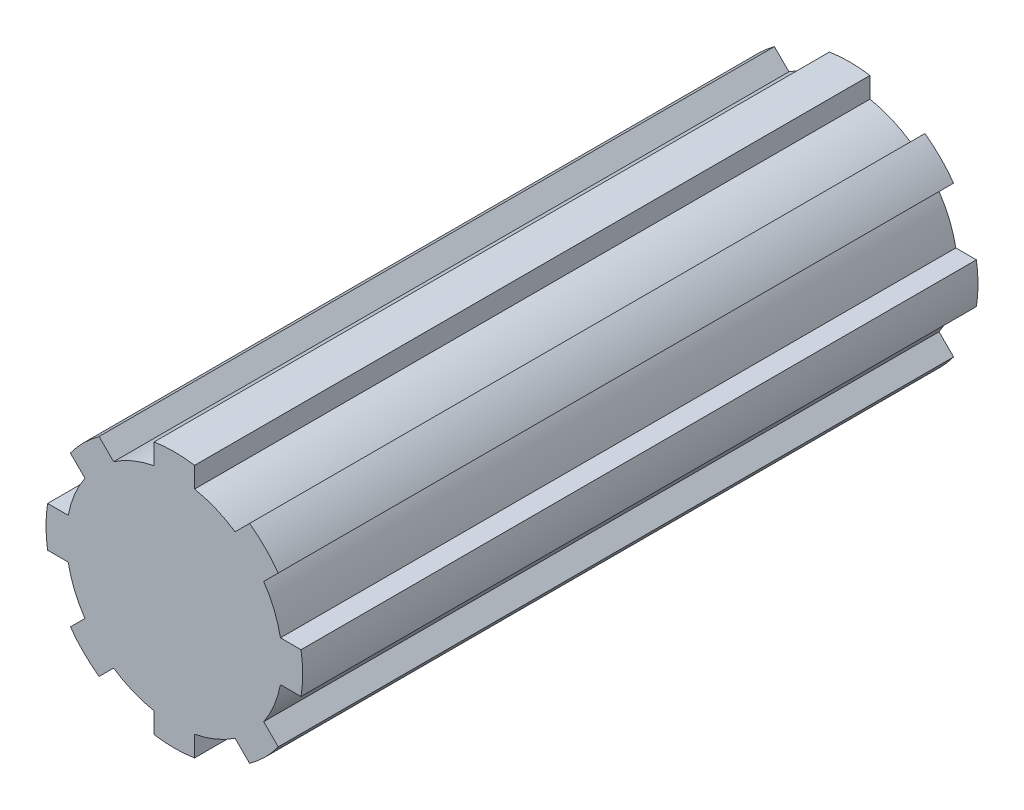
ISO-10303-21;
HEADER;
FILE_DESCRIPTION(('STEP AP214'),'2;1');
FILE_NAME('part.step','',(''),(''),'','','');
FILE_SCHEMA(('AUTOMOTIVE_DESIGN { 1 0 10303 214 1 1 1 1 }'));
ENDSEC;
DATA;
#1=APPLICATION_CONTEXT('core data for automotive mechanical design processes');
#2=APPLICATION_PROTOCOL_DEFINITION('international standard','automotive_design',2000,#1);
#3=PRODUCT_CONTEXT('',#1,'mechanical');
#4=PRODUCT('Part','Part','',(#3));
#5=PRODUCT_RELATED_PRODUCT_CATEGORY('part','',(#4));
#6=PRODUCT_DEFINITION_FORMATION('','',#4);
#7=PRODUCT_DEFINITION_CONTEXT('part definition',#1,'design');
#8=PRODUCT_DEFINITION('design','',#6,#7);
#9=PRODUCT_DEFINITION_SHAPE('','',#8);
#10=(LENGTH_UNIT() NAMED_UNIT(*) SI_UNIT(.MILLI.,.METRE.));
#11=(NAMED_UNIT(*) PLANE_ANGLE_UNIT() SI_UNIT($,.RADIAN.));
#12=(NAMED_UNIT(*) SI_UNIT($,.STERADIAN.) SOLID_ANGLE_UNIT());
#13=UNCERTAINTY_MEASURE_WITH_UNIT(LENGTH_MEASURE(1.E-05),#10,'distance_accuracy_value','');
#14=(GEOMETRIC_REPRESENTATION_CONTEXT(3) GLOBAL_UNCERTAINTY_ASSIGNED_CONTEXT((#13)) GLOBAL_UNIT_ASSIGNED_CONTEXT((#10,
#11,#12)) REPRESENTATION_CONTEXT('',''));
#15=CARTESIAN_POINT('',(0.,0.,0.));
#16=DIRECTION('',(0.,0.,1.));
#17=DIRECTION('',(1.,0.,0.));
#18=AXIS2_PLACEMENT_3D('',#15,#16,#17);
#19=CARTESIAN_POINT('',(0.,0.,50.));
#20=DIRECTION('',(0.,0.,-1.));
#21=DIRECTION('',(-1.,0.,0.));
#22=AXIS2_PLACEMENT_3D('',#19,#20,#21);
#23=CYLINDRICAL_SURFACE('',#22,16.);
#24=DIRECTION('',(0.,0.,-1.));
#25=VECTOR('',#24,1.);
#26=CARTESIAN_POINT('',(8.99173504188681,13.2343757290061,50.));
#27=LINE('',#26,#25);
#28=CARTESIAN_POINT('',(8.99173504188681,13.2343757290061,-50.));
#29=VERTEX_POINT('',#28);
#30=CARTESIAN_POINT('',(8.99173504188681,13.2343757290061,50.));
#31=VERTEX_POINT('',#30);
#32=EDGE_CURVE('E440',#29,#31,#27,.F.);
#33=ORIENTED_EDGE('',*,*,#32,.F.);
#34=CARTESIAN_POINT('',(0.,0.,-50.));
#35=DIRECTION('',(0.,0.,1.));
#36=DIRECTION('',(1.,0.,0.));
#37=AXIS2_PLACEMENT_3D('',#34,#35,#36);
#38=CIRCLE('',#37,16.);
#39=CARTESIAN_POINT('',(3.,15.7162336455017,-50.));
#40=VERTEX_POINT('',#39);
#41=EDGE_CURVE('E469',#29,#40,#38,.T.);
#42=ORIENTED_EDGE('',*,*,#41,.T.);
#43=DIRECTION('',(0.,0.,-1.));
#44=VECTOR('',#43,1.);
#45=CARTESIAN_POINT('',(3.,15.7162336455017,50.));
#46=LINE('',#45,#44);
#47=CARTESIAN_POINT('',(3.,15.7162336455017,50.));
#48=VERTEX_POINT('',#47);
#49=EDGE_CURVE('E464',#48,#40,#46,.T.);
#50=ORIENTED_EDGE('',*,*,#49,.F.);
#51=CARTESIAN_POINT('',(0.,0.,50.));
#52=DIRECTION('',(0.,0.,1.));
#53=DIRECTION('',(1.,0.,0.));
#54=AXIS2_PLACEMENT_3D('',#51,#52,#53);
#55=CIRCLE('',#54,16.);
#56=EDGE_CURVE('E41',#31,#48,#55,.T.);
#57=ORIENTED_EDGE('',*,*,#56,.F.);
#58=EDGE_LOOP('',(#33,#42,#50,#57));
#59=FACE_BOUND('',#58,.T.);
#60=ADVANCED_FACE('F32',(#59),#23,.T.);
#61=DIRECTION('',(0.,0.,-1.));
#62=VECTOR('',#61,1.);
#63=CARTESIAN_POINT('',(13.2343757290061,8.99173504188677,50.));
#64=LINE('',#63,#62);
#65=CARTESIAN_POINT('',(13.2343757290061,8.99173504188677,50.));
#66=VERTEX_POINT('',#65);
#67=CARTESIAN_POINT('',(13.2343757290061,8.99173504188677,-50.));
#68=VERTEX_POINT('',#67);
#69=EDGE_CURVE('E55',#66,#68,#64,.T.);
#70=ORIENTED_EDGE('',*,*,#69,.F.);
#71=CARTESIAN_POINT('',(15.7162336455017,2.99999999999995,50.));
#72=VERTEX_POINT('',#71);
#73=EDGE_CURVE('E476',#72,#66,#55,.T.);
#74=ORIENTED_EDGE('',*,*,#73,.F.);
#75=DIRECTION('',(0.,0.,-1.));
#76=VECTOR('',#75,1.);
#77=CARTESIAN_POINT('',(15.7162336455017,2.99999999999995,50.));
#78=LINE('',#77,#76);
#79=CARTESIAN_POINT('',(15.7162336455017,2.99999999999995,-50.));
#80=VERTEX_POINT('',#79);
#81=EDGE_CURVE('E436',#80,#72,#78,.F.);
#82=ORIENTED_EDGE('',*,*,#81,.F.);
#83=EDGE_CURVE('E472',#80,#68,#38,.T.);
#84=ORIENTED_EDGE('',*,*,#83,.T.);
#85=EDGE_LOOP('',(#70,#74,#82,#84));
#86=FACE_BOUND('',#85,.T.);
#87=ADVANCED_FACE('F522',(#86),#23,.T.);
#88=DIRECTION('',(0.,0.,-1.));
#89=VECTOR('',#88,1.);
#90=CARTESIAN_POINT('',(-8.99173504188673,13.2343757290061,50.));
#91=LINE('',#90,#89);
#92=CARTESIAN_POINT('',(-8.99173504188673,13.2343757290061,50.));
#93=VERTEX_POINT('',#92);
#94=CARTESIAN_POINT('',(-8.99173504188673,13.2343757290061,-50.));
#95=VERTEX_POINT('',#94);
#96=EDGE_CURVE('E433',#93,#95,#91,.T.);
#97=ORIENTED_EDGE('',*,*,#96,.F.);
#98=CARTESIAN_POINT('',(-3.,15.7162336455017,50.));
#99=VERTEX_POINT('',#98);
#100=EDGE_CURVE('E11',#99,#93,#55,.T.);
#101=ORIENTED_EDGE('',*,*,#100,.F.);
#102=DIRECTION('',(0.,0.,-1.));
#103=VECTOR('',#102,1.);
#104=CARTESIAN_POINT('',(-3.,15.7162336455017,50.));
#105=LINE('',#104,#103);
#106=CARTESIAN_POINT('',(-3.,15.7162336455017,-50.));
#107=VERTEX_POINT('',#106);
#108=EDGE_CURVE('E467',#107,#99,#105,.F.);
#109=ORIENTED_EDGE('',*,*,#108,.F.);
#110=EDGE_CURVE('E35',#107,#95,#38,.T.);
#111=ORIENTED_EDGE('',*,*,#110,.T.);
#112=EDGE_LOOP('',(#97,#101,#109,#111));
#113=FACE_BOUND('',#112,.T.);
#114=ADVANCED_FACE('F527',(#113),#23,.T.);
#115=DIRECTION('',(0.,0.,-1.));
#116=VECTOR('',#115,1.);
#117=CARTESIAN_POINT('',(15.7162336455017,-3.00000000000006,50.));
#118=LINE('',#117,#116);
#119=CARTESIAN_POINT('',(15.7162336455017,-3.00000000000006,50.));
#120=VERTEX_POINT('',#119);
#121=CARTESIAN_POINT('',(15.7162336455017,-3.00000000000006,-50.));
#122=VERTEX_POINT('',#121);
#123=EDGE_CURVE('E430',#120,#122,#118,.T.);
#124=ORIENTED_EDGE('',*,*,#123,.F.);
#125=CARTESIAN_POINT('',(13.234375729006,-8.99173504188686,50.));
#126=VERTEX_POINT('',#125);
#127=EDGE_CURVE('E505',#126,#120,#55,.T.);
#128=ORIENTED_EDGE('',*,*,#127,.F.);
#129=DIRECTION('',(0.,0.,-1.));
#130=VECTOR('',#129,1.);
#131=CARTESIAN_POINT('',(13.234375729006,-8.99173504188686,50.));
#132=LINE('',#131,#130);
#133=CARTESIAN_POINT('',(13.234375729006,-8.99173504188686,-50.));
#134=VERTEX_POINT('',#133);
#135=EDGE_CURVE('E427',#134,#126,#132,.F.);
#136=ORIENTED_EDGE('',*,*,#135,.F.);
#137=EDGE_CURVE('E473',#134,#122,#38,.T.);
#138=ORIENTED_EDGE('',*,*,#137,.T.);
#139=EDGE_LOOP('',(#124,#128,#136,#138));
#140=FACE_BOUND('',#139,.T.);
#141=ADVANCED_FACE('F490',(#140),#23,.T.);
#142=DIRECTION('',(0.,0.,-1.));
#143=VECTOR('',#142,1.);
#144=CARTESIAN_POINT('',(8.99173504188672,-13.2343757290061,50.));
#145=LINE('',#144,#143);
#146=CARTESIAN_POINT('',(8.99173504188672,-13.2343757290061,50.));
#147=VERTEX_POINT('',#146);
#148=CARTESIAN_POINT('',(8.99173504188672,-13.2343757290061,-50.));
#149=VERTEX_POINT('',#148);
#150=EDGE_CURVE('E424',#147,#149,#145,.T.);
#151=ORIENTED_EDGE('',*,*,#150,.F.);
#152=CARTESIAN_POINT('',(2.99999999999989,-15.7162336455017,50.));
#153=VERTEX_POINT('',#152);
#154=EDGE_CURVE('E506',#153,#147,#55,.T.);
#155=ORIENTED_EDGE('',*,*,#154,.F.);
#156=DIRECTION('',(0.,0.,-1.));
#157=VECTOR('',#156,1.);
#158=CARTESIAN_POINT('',(2.99999999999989,-15.7162336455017,50.));
#159=LINE('',#158,#157);
#160=CARTESIAN_POINT('',(2.99999999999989,-15.7162336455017,-50.));
#161=VERTEX_POINT('',#160);
#162=EDGE_CURVE('E421',#161,#153,#159,.F.);
#163=ORIENTED_EDGE('',*,*,#162,.F.);
#164=EDGE_CURVE('E483',#161,#149,#38,.T.);
#165=ORIENTED_EDGE('',*,*,#164,.T.);
#166=EDGE_LOOP('',(#151,#155,#163,#165));
#167=FACE_BOUND('',#166,.T.);
#168=ADVANCED_FACE('F576',(#167),#23,.T.);
#169=DIRECTION('',(0.,0.,-1.));
#170=VECTOR('',#169,1.);
#171=CARTESIAN_POINT('',(-3.00000000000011,-15.7162336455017,50.));
#172=LINE('',#171,#170);
#173=CARTESIAN_POINT('',(-3.00000000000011,-15.7162336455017,50.));
#174=VERTEX_POINT('',#173);
#175=CARTESIAN_POINT('',(-3.00000000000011,-15.7162336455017,-50.));
#176=VERTEX_POINT('',#175);
#177=EDGE_CURVE('E418',#174,#176,#172,.T.);
#178=ORIENTED_EDGE('',*,*,#177,.F.);
#179=CARTESIAN_POINT('',(-8.99173504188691,-13.234375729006,50.));
#180=VERTEX_POINT('',#179);
#181=EDGE_CURVE('E508',#180,#174,#55,.T.);
#182=ORIENTED_EDGE('',*,*,#181,.F.);
#183=DIRECTION('',(0.,0.,-1.));
#184=VECTOR('',#183,1.);
#185=CARTESIAN_POINT('',(-8.99173504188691,-13.234375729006,50.));
#186=LINE('',#185,#184);
#187=CARTESIAN_POINT('',(-8.99173504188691,-13.234375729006,-50.));
#188=VERTEX_POINT('',#187);
#189=EDGE_CURVE('E415',#188,#180,#186,.F.);
#190=ORIENTED_EDGE('',*,*,#189,.F.);
#191=EDGE_CURVE('E480',#188,#176,#38,.T.);
#192=ORIENTED_EDGE('',*,*,#191,.T.);
#193=EDGE_LOOP('',(#178,#182,#190,#192));
#194=FACE_BOUND('',#193,.T.);
#195=ADVANCED_FACE('F535',(#194),#23,.T.);
#196=DIRECTION('',(0.,0.,-1.));
#197=VECTOR('',#196,1.);
#198=CARTESIAN_POINT('',(-13.2343757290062,-8.99173504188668,50.));
#199=LINE('',#198,#197);
#200=CARTESIAN_POINT('',(-13.2343757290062,-8.99173504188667,50.));
#201=VERTEX_POINT('',#200);
#202=CARTESIAN_POINT('',(-13.2343757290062,-8.99173504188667,-50.));
#203=VERTEX_POINT('',#202);
#204=EDGE_CURVE('E412',#201,#203,#199,.T.);
#205=ORIENTED_EDGE('',*,*,#204,.F.);
#206=CARTESIAN_POINT('',(-15.7162336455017,-2.99999999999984,50.));
#207=VERTEX_POINT('',#206);
#208=EDGE_CURVE('E540',#207,#201,#55,.T.);
#209=ORIENTED_EDGE('',*,*,#208,.F.);
#210=DIRECTION('',(0.,0.,-1.));
#211=VECTOR('',#210,1.);
#212=CARTESIAN_POINT('',(-15.7162336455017,-2.99999999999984,50.));
#213=LINE('',#212,#211);
#214=CARTESIAN_POINT('',(-15.7162336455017,-2.99999999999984,-50.));
#215=VERTEX_POINT('',#214);
#216=EDGE_CURVE('E409',#215,#207,#213,.F.);
#217=ORIENTED_EDGE('',*,*,#216,.F.);
#218=EDGE_CURVE('E477',#215,#203,#38,.T.);
#219=ORIENTED_EDGE('',*,*,#218,.T.);
#220=EDGE_LOOP('',(#205,#209,#217,#219));
#221=FACE_BOUND('',#220,.T.);
#222=ADVANCED_FACE('F529',(#221),#23,.T.);
#223=DIRECTION('',(0.,0.,-1.));
#224=VECTOR('',#223,1.);
#225=CARTESIAN_POINT('',(-15.7162336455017,3.00000000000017,50.));
#226=LINE('',#225,#224);
#227=CARTESIAN_POINT('',(-15.7162336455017,3.00000000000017,50.));
#228=VERTEX_POINT('',#227);
#229=CARTESIAN_POINT('',(-15.7162336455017,3.00000000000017,-50.));
#230=VERTEX_POINT('',#229);
#231=EDGE_CURVE('E406',#228,#230,#226,.T.);
#232=ORIENTED_EDGE('',*,*,#231,.F.);
#233=CARTESIAN_POINT('',(-13.234375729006,8.99173504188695,50.));
#234=VERTEX_POINT('',#233);
#235=EDGE_CURVE('E40',#234,#228,#55,.T.);
#236=ORIENTED_EDGE('',*,*,#235,.F.);
#237=DIRECTION('',(0.,0.,-1.));
#238=VECTOR('',#237,1.);
#239=CARTESIAN_POINT('',(-13.234375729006,8.99173504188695,50.));
#240=LINE('',#239,#238);
#241=CARTESIAN_POINT('',(-13.234375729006,8.99173504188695,-50.));
#242=VERTEX_POINT('',#241);
#243=EDGE_CURVE('E250',#242,#234,#240,.F.);
#244=ORIENTED_EDGE('',*,*,#243,.F.);
#245=EDGE_CURVE('E474',#242,#230,#38,.T.);
#246=ORIENTED_EDGE('',*,*,#245,.T.);
#247=EDGE_LOOP('',(#232,#236,#244,#246));
#248=FACE_BOUND('',#247,.T.);
#249=ADVANCED_FACE('F523',(#248),#23,.T.);
#250=CARTESIAN_POINT('',(0.,0.,50.));
#251=DIRECTION('',(0.,0.,1.));
#252=DIRECTION('',(1.,0.,0.));
#253=AXIS2_PLACEMENT_3D('',#250,#251,#252);
#254=PLANE('',#253);
#255=ORIENTED_EDGE('',*,*,#73,.T.);
#256=DIRECTION('',(0.707106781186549,0.707106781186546,0.));
#257=VECTOR('',#256,1.);
#258=CARTESIAN_POINT('',(2.12132034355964,-2.12132034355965,50.));
#259=LINE('',#258,#257);
#260=CARTESIAN_POINT('',(15.3878195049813,11.1451788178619,50.));
#261=VERTEX_POINT('',#260);
#262=EDGE_CURVE('E391',#66,#261,#259,.T.);
#263=ORIENTED_EDGE('',*,*,#262,.T.);
#264=CARTESIAN_POINT('',(0.,0.,50.));
#265=DIRECTION('',(0.,0.,1.));
#266=DIRECTION('',(0.707106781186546,-0.707106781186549,0.));
#267=AXIS2_PLACEMENT_3D('',#264,#265,#266);
#268=CIRCLE('',#267,19.);
#269=CARTESIAN_POINT('',(11.145178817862,15.3878195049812,50.));
#270=VERTEX_POINT('',#269);
#271=EDGE_CURVE('E384',#261,#270,#268,.T.);
#272=ORIENTED_EDGE('',*,*,#271,.T.);
#273=DIRECTION('',(-0.707106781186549,-0.707106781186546,0.));
#274=VECTOR('',#273,1.);
#275=CARTESIAN_POINT('',(11.145178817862,15.3878195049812,50.));
#276=LINE('',#275,#274);
#277=EDGE_CURVE('E387',#270,#31,#276,.T.);
#278=ORIENTED_EDGE('',*,*,#277,.T.);
#279=ORIENTED_EDGE('',*,*,#56,.T.);
#280=DIRECTION('',(0.,1.,0.));
#281=VECTOR('',#280,1.);
#282=CARTESIAN_POINT('',(3.,0.,50.));
#283=LINE('',#282,#281);
#284=CARTESIAN_POINT('',(3.,18.7616630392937,50.));
#285=VERTEX_POINT('',#284);
#286=EDGE_CURVE('E450',#48,#285,#283,.T.);
#287=ORIENTED_EDGE('',*,*,#286,.T.);
#288=CARTESIAN_POINT('',(0.,0.,50.));
#289=DIRECTION('',(0.,0.,1.));
#290=DIRECTION('',(1.,0.,0.));
#291=AXIS2_PLACEMENT_3D('',#288,#289,#290);
#292=CIRCLE('',#291,19.);
#293=CARTESIAN_POINT('',(-3.,18.7616630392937,50.));
#294=VERTEX_POINT('',#293);
#295=EDGE_CURVE('E443',#285,#294,#292,.T.);
#296=ORIENTED_EDGE('',*,*,#295,.T.);
#297=DIRECTION('',(0.,-1.,0.));
#298=VECTOR('',#297,1.);
#299=CARTESIAN_POINT('',(-3.,18.7616630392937,50.));
#300=LINE('',#299,#298);
#301=EDGE_CURVE('E446',#294,#99,#300,.T.);
#302=ORIENTED_EDGE('',*,*,#301,.T.);
#303=ORIENTED_EDGE('',*,*,#100,.T.);
#304=DIRECTION('',(-0.707106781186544,0.707106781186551,0.));
#305=VECTOR('',#304,1.);
#306=CARTESIAN_POINT('',(15.3878195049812,-11.145178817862,50.));
#307=LINE('',#306,#305);
#308=CARTESIAN_POINT('',(-11.1451788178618,15.3878195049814,50.));
#309=VERTEX_POINT('',#308);
#310=EDGE_CURVE('E259',#93,#309,#307,.T.);
#311=ORIENTED_EDGE('',*,*,#310,.T.);
#312=CARTESIAN_POINT('',(0.,0.,50.));
#313=DIRECTION('',(0.,0.,1.));
#314=DIRECTION('',(0.707106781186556,0.707106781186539,0.));
#315=AXIS2_PLACEMENT_3D('',#312,#313,#314);
#316=CIRCLE('',#315,19.);
#317=CARTESIAN_POINT('',(-15.3878195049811,11.1451788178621,50.));
#318=VERTEX_POINT('',#317);
#319=EDGE_CURVE('E254',#309,#318,#316,.T.);
#320=ORIENTED_EDGE('',*,*,#319,.T.);
#321=DIRECTION('',(0.707106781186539,-0.707106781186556,0.));
#322=VECTOR('',#321,1.);
#323=CARTESIAN_POINT('',(-15.3878195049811,11.1451788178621,50.));
#324=LINE('',#323,#322);
#325=EDGE_CURVE('E243',#318,#234,#324,.T.);
#326=ORIENTED_EDGE('',*,*,#325,.T.);
#327=ORIENTED_EDGE('',*,*,#235,.T.);
#328=DIRECTION('',(-1.,0.,0.));
#329=VECTOR('',#328,1.);
#330=CARTESIAN_POINT('',(0.,3.,50.));
#331=LINE('',#330,#329);
#332=CARTESIAN_POINT('',(-18.7616630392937,3.0000000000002,50.));
#333=VERTEX_POINT('',#332);
#334=EDGE_CURVE('E283',#228,#333,#331,.T.);
#335=ORIENTED_EDGE('',*,*,#334,.T.);
#336=CARTESIAN_POINT('',(0.,0.,50.));
#337=DIRECTION('',(0.,0.,1.));
#338=DIRECTION('',(0.,1.,0.));
#339=AXIS2_PLACEMENT_3D('',#336,#337,#338);
#340=CIRCLE('',#339,19.);
#341=CARTESIAN_POINT('',(-18.7616630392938,-2.9999999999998,50.));
#342=VERTEX_POINT('',#341);
#343=EDGE_CURVE('E276',#333,#342,#340,.T.);
#344=ORIENTED_EDGE('',*,*,#343,.T.);
#345=DIRECTION('',(1.,0.,0.));
#346=VECTOR('',#345,1.);
#347=CARTESIAN_POINT('',(-18.7616630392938,-2.9999999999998,50.));
#348=LINE('',#347,#346);
#349=EDGE_CURVE('E279',#342,#207,#348,.T.);
#350=ORIENTED_EDGE('',*,*,#349,.T.);
#351=ORIENTED_EDGE('',*,*,#208,.T.);
#352=DIRECTION('',(-0.707106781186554,-0.707106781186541,0.));
#353=VECTOR('',#352,1.);
#354=CARTESIAN_POINT('',(-2.12132034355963,2.12132034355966,50.));
#355=LINE('',#354,#353);
#356=CARTESIAN_POINT('',(-15.3878195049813,-11.1451788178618,50.));
#357=VERTEX_POINT('',#356);
#358=EDGE_CURVE('E302',#201,#357,#355,.T.);
#359=ORIENTED_EDGE('',*,*,#358,.T.);
#360=CARTESIAN_POINT('',(0.,0.,50.));
#361=DIRECTION('',(0.,0.,1.));
#362=DIRECTION('',(-0.707106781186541,0.707106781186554,0.));
#363=AXIS2_PLACEMENT_3D('',#360,#361,#362);
#364=CIRCLE('',#363,19.);
#365=CARTESIAN_POINT('',(-11.1451788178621,-15.3878195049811,50.));
#366=VERTEX_POINT('',#365);
#367=EDGE_CURVE('E295',#357,#366,#364,.T.);
#368=ORIENTED_EDGE('',*,*,#367,.T.);
#369=DIRECTION('',(0.707106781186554,0.707106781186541,0.));
#370=VECTOR('',#369,1.);
#371=CARTESIAN_POINT('',(-11.1451788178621,-15.3878195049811,50.));
#372=LINE('',#371,#370);
#373=EDGE_CURVE('E298',#366,#180,#372,.T.);
#374=ORIENTED_EDGE('',*,*,#373,.T.);
#375=ORIENTED_EDGE('',*,*,#181,.T.);
#376=DIRECTION('',(0.,-1.,0.));
#377=VECTOR('',#376,1.);
#378=CARTESIAN_POINT('',(-3.,0.,50.));
#379=LINE('',#378,#377);
#380=CARTESIAN_POINT('',(-3.00000000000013,-18.7616630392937,50.));
#381=VERTEX_POINT('',#380);
#382=EDGE_CURVE('E324',#174,#381,#379,.T.);
#383=ORIENTED_EDGE('',*,*,#382,.T.);
#384=CARTESIAN_POINT('',(0.,0.,50.));
#385=DIRECTION('',(0.,0.,1.));
#386=DIRECTION('',(-1.,0.,0.));
#387=AXIS2_PLACEMENT_3D('',#384,#385,#386);
#388=CIRCLE('',#387,19.);
#389=CARTESIAN_POINT('',(2.99999999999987,-18.7616630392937,50.));
#390=VERTEX_POINT('',#389);
#391=EDGE_CURVE('E317',#381,#390,#388,.T.);
#392=ORIENTED_EDGE('',*,*,#391,.T.);
#393=DIRECTION('',(0.,1.,0.));
#394=VECTOR('',#393,1.);
#395=CARTESIAN_POINT('',(2.99999999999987,-18.7616630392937,50.));
#396=LINE('',#395,#394);
#397=EDGE_CURVE('E320',#390,#153,#396,.T.);
#398=ORIENTED_EDGE('',*,*,#397,.T.);
#399=ORIENTED_EDGE('',*,*,#154,.T.);
#400=DIRECTION('',(0.707106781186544,-0.707106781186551,0.));
#401=VECTOR('',#400,1.);
#402=CARTESIAN_POINT('',(-2.12132034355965,-2.12132034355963,50.));
#403=LINE('',#402,#401);
#404=CARTESIAN_POINT('',(11.1451788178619,-15.3878195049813,50.));
#405=VERTEX_POINT('',#404);
#406=EDGE_CURVE('E346',#147,#405,#403,.T.);
#407=ORIENTED_EDGE('',*,*,#406,.T.);
#408=CARTESIAN_POINT('',(0.,0.,50.));
#409=DIRECTION('',(0.,0.,1.));
#410=DIRECTION('',(-0.707106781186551,-0.707106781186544,0.));
#411=AXIS2_PLACEMENT_3D('',#408,#409,#410);
#412=CIRCLE('',#411,19.);
#413=CARTESIAN_POINT('',(15.3878195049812,-11.145178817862,50.));
#414=VERTEX_POINT('',#413);
#415=EDGE_CURVE('E339',#405,#414,#412,.T.);
#416=ORIENTED_EDGE('',*,*,#415,.T.);
#417=EDGE_CURVE('E343',#414,#126,#307,.T.);
#418=ORIENTED_EDGE('',*,*,#417,.T.);
#419=ORIENTED_EDGE('',*,*,#127,.T.);
#420=DIRECTION('',(1.,0.,0.));
#421=VECTOR('',#420,1.);
#422=CARTESIAN_POINT('',(0.,-3.,50.));
#423=LINE('',#422,#421);
#424=CARTESIAN_POINT('',(18.7616630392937,-3.00000000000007,50.));
#425=VERTEX_POINT('',#424);
#426=EDGE_CURVE('E369',#120,#425,#423,.T.);
#427=ORIENTED_EDGE('',*,*,#426,.T.);
#428=CARTESIAN_POINT('',(0.,0.,50.));
#429=DIRECTION('',(0.,0.,1.));
#430=DIRECTION('',(0.,-1.,0.));
#431=AXIS2_PLACEMENT_3D('',#428,#429,#430);
#432=CIRCLE('',#431,19.);
#433=CARTESIAN_POINT('',(18.7616630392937,2.99999999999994,50.));
#434=VERTEX_POINT('',#433);
#435=EDGE_CURVE('E362',#425,#434,#432,.T.);
#436=ORIENTED_EDGE('',*,*,#435,.T.);
#437=DIRECTION('',(-1.,0.,0.));
#438=VECTOR('',#437,1.);
#439=CARTESIAN_POINT('',(18.7616630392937,2.99999999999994,50.));
#440=LINE('',#439,#438);
#441=EDGE_CURVE('E365',#434,#72,#440,.T.);
#442=ORIENTED_EDGE('',*,*,#441,.T.);
#443=EDGE_LOOP('',(#255,#263,#272,#278,#279,#287,#296,#302,#303,#311,#320,#326,#327,#335,#344,
#350,#351,#359,#368,#374,#375,#383,#392,#398,#399,#407,#416,#418,#419,#427,#436,#442));
#444=FACE_BOUND('',#443,.T.);
#445=ADVANCED_FACE('F257',(#444),#254,.T.);
#446=CARTESIAN_POINT('',(0.,0.,-50.));
#447=DIRECTION('',(0.,0.,1.));
#448=DIRECTION('',(1.,0.,0.));
#449=AXIS2_PLACEMENT_3D('',#446,#447,#448);
#450=PLANE('',#449);
#451=ORIENTED_EDGE('',*,*,#41,.F.);
#452=DIRECTION('',(-0.707106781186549,-0.707106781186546,0.));
#453=VECTOR('',#452,1.);
#454=CARTESIAN_POINT('',(11.145178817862,15.3878195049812,-50.));
#455=LINE('',#454,#453);
#456=CARTESIAN_POINT('',(11.145178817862,15.3878195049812,-50.));
#457=VERTEX_POINT('',#456);
#458=EDGE_CURVE('E396',#457,#29,#455,.T.);
#459=ORIENTED_EDGE('',*,*,#458,.F.);
#460=CARTESIAN_POINT('',(0.,0.,-50.));
#461=DIRECTION('',(0.,0.,1.));
#462=DIRECTION('',(0.707106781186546,-0.707106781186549,0.));
#463=AXIS2_PLACEMENT_3D('',#460,#461,#462);
#464=CIRCLE('',#463,19.);
#465=CARTESIAN_POINT('',(15.3878195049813,11.1451788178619,-50.));
#466=VERTEX_POINT('',#465);
#467=EDGE_CURVE('E383',#466,#457,#464,.T.);
#468=ORIENTED_EDGE('',*,*,#467,.F.);
#469=DIRECTION('',(0.707106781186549,0.707106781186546,0.));
#470=VECTOR('',#469,1.);
#471=CARTESIAN_POINT('',(2.12132034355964,-2.12132034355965,-50.));
#472=LINE('',#471,#470);
#473=EDGE_CURVE('E388',#68,#466,#472,.T.);
#474=ORIENTED_EDGE('',*,*,#473,.F.);
#475=ORIENTED_EDGE('',*,*,#83,.F.);
#476=DIRECTION('',(-1.,0.,0.));
#477=VECTOR('',#476,1.);
#478=CARTESIAN_POINT('',(18.7616630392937,2.99999999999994,-50.));
#479=LINE('',#478,#477);
#480=CARTESIAN_POINT('',(18.7616630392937,2.99999999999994,-50.));
#481=VERTEX_POINT('',#480);
#482=EDGE_CURVE('E374',#481,#80,#479,.T.);
#483=ORIENTED_EDGE('',*,*,#482,.F.);
#484=CARTESIAN_POINT('',(0.,0.,-50.));
#485=DIRECTION('',(0.,0.,1.));
#486=DIRECTION('',(0.,-1.,0.));
#487=AXIS2_PLACEMENT_3D('',#484,#485,#486);
#488=CIRCLE('',#487,19.);
#489=CARTESIAN_POINT('',(18.7616630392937,-3.00000000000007,-50.));
#490=VERTEX_POINT('',#489);
#491=EDGE_CURVE('E361',#490,#481,#488,.T.);
#492=ORIENTED_EDGE('',*,*,#491,.F.);
#493=DIRECTION('',(1.,0.,0.));
#494=VECTOR('',#493,1.);
#495=CARTESIAN_POINT('',(0.,-3.,-50.));
#496=LINE('',#495,#494);
#497=EDGE_CURVE('E366',#122,#490,#496,.T.);
#498=ORIENTED_EDGE('',*,*,#497,.F.);
#499=ORIENTED_EDGE('',*,*,#137,.F.);
#500=DIRECTION('',(-0.707106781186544,0.707106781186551,0.));
#501=VECTOR('',#500,1.);
#502=CARTESIAN_POINT('',(15.3878195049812,-11.145178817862,-50.));
#503=LINE('',#502,#501);
#504=CARTESIAN_POINT('',(15.3878195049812,-11.145178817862,-50.));
#505=VERTEX_POINT('',#504);
#506=EDGE_CURVE('E352',#505,#134,#503,.T.);
#507=ORIENTED_EDGE('',*,*,#506,.F.);
#508=CARTESIAN_POINT('',(0.,0.,-50.));
#509=DIRECTION('',(0.,0.,1.));
#510=DIRECTION('',(-0.707106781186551,-0.707106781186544,0.));
#511=AXIS2_PLACEMENT_3D('',#508,#509,#510);
#512=CIRCLE('',#511,19.);
#513=CARTESIAN_POINT('',(11.1451788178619,-15.3878195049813,-50.));
#514=VERTEX_POINT('',#513);
#515=EDGE_CURVE('E338',#514,#505,#512,.T.);
#516=ORIENTED_EDGE('',*,*,#515,.F.);
#517=DIRECTION('',(0.707106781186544,-0.707106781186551,0.));
#518=VECTOR('',#517,1.);
#519=CARTESIAN_POINT('',(-2.12132034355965,-2.12132034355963,-50.));
#520=LINE('',#519,#518);
#521=EDGE_CURVE('E342',#149,#514,#520,.T.);
#522=ORIENTED_EDGE('',*,*,#521,.F.);
#523=ORIENTED_EDGE('',*,*,#164,.F.);
#524=DIRECTION('',(0.,1.,0.));
#525=VECTOR('',#524,1.);
#526=CARTESIAN_POINT('',(2.99999999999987,-18.7616630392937,-50.));
#527=LINE('',#526,#525);
#528=CARTESIAN_POINT('',(2.99999999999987,-18.7616630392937,-50.));
#529=VERTEX_POINT('',#528);
#530=EDGE_CURVE('E329',#529,#161,#527,.T.);
#531=ORIENTED_EDGE('',*,*,#530,.F.);
#532=CARTESIAN_POINT('',(0.,0.,-50.));
#533=DIRECTION('',(0.,0.,1.));
#534=DIRECTION('',(-1.,0.,0.));
#535=AXIS2_PLACEMENT_3D('',#532,#533,#534);
#536=CIRCLE('',#535,19.);
#537=CARTESIAN_POINT('',(-3.00000000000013,-18.7616630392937,-50.));
#538=VERTEX_POINT('',#537);
#539=EDGE_CURVE('E316',#538,#529,#536,.T.);
#540=ORIENTED_EDGE('',*,*,#539,.F.);
#541=DIRECTION('',(0.,-1.,0.));
#542=VECTOR('',#541,1.);
#543=CARTESIAN_POINT('',(-3.,0.,-50.));
#544=LINE('',#543,#542);
#545=EDGE_CURVE('E321',#176,#538,#544,.T.);
#546=ORIENTED_EDGE('',*,*,#545,.F.);
#547=ORIENTED_EDGE('',*,*,#191,.F.);
#548=DIRECTION('',(0.707106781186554,0.707106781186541,0.));
#549=VECTOR('',#548,1.);
#550=CARTESIAN_POINT('',(-11.1451788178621,-15.3878195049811,-50.));
#551=LINE('',#550,#549);
#552=CARTESIAN_POINT('',(-11.1451788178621,-15.3878195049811,-50.));
#553=VERTEX_POINT('',#552);
#554=EDGE_CURVE('E307',#553,#188,#551,.T.);
#555=ORIENTED_EDGE('',*,*,#554,.F.);
#556=CARTESIAN_POINT('',(0.,0.,-50.));
#557=DIRECTION('',(0.,0.,1.));
#558=DIRECTION('',(-0.707106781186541,0.707106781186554,0.));
#559=AXIS2_PLACEMENT_3D('',#556,#557,#558);
#560=CIRCLE('',#559,19.);
#561=CARTESIAN_POINT('',(-15.3878195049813,-11.1451788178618,-50.));
#562=VERTEX_POINT('',#561);
#563=EDGE_CURVE('E294',#562,#553,#560,.T.);
#564=ORIENTED_EDGE('',*,*,#563,.F.);
#565=DIRECTION('',(-0.707106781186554,-0.707106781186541,0.));
#566=VECTOR('',#565,1.);
#567=CARTESIAN_POINT('',(-2.12132034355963,2.12132034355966,-50.));
#568=LINE('',#567,#566);
#569=EDGE_CURVE('E299',#203,#562,#568,.T.);
#570=ORIENTED_EDGE('',*,*,#569,.F.);
#571=ORIENTED_EDGE('',*,*,#218,.F.);
#572=DIRECTION('',(1.,0.,0.));
#573=VECTOR('',#572,1.);
#574=CARTESIAN_POINT('',(-18.7616630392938,-2.9999999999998,-50.));
#575=LINE('',#574,#573);
#576=CARTESIAN_POINT('',(-18.7616630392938,-2.9999999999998,-50.));
#577=VERTEX_POINT('',#576);
#578=EDGE_CURVE('E271',#577,#215,#575,.T.);
#579=ORIENTED_EDGE('',*,*,#578,.F.);
#580=CARTESIAN_POINT('',(0.,0.,-50.));
#581=DIRECTION('',(0.,0.,1.));
#582=DIRECTION('',(0.,1.,0.));
#583=AXIS2_PLACEMENT_3D('',#580,#581,#582);
#584=CIRCLE('',#583,19.);
#585=CARTESIAN_POINT('',(-18.7616630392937,3.0000000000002,-50.));
#586=VERTEX_POINT('',#585);
#587=EDGE_CURVE('E268',#586,#577,#584,.T.);
#588=ORIENTED_EDGE('',*,*,#587,.F.);
#589=DIRECTION('',(-1.,0.,0.));
#590=VECTOR('',#589,1.);
#591=CARTESIAN_POINT('',(0.,3.,-50.));
#592=LINE('',#591,#590);
#593=EDGE_CURVE('E280',#230,#586,#592,.T.);
#594=ORIENTED_EDGE('',*,*,#593,.F.);
#595=ORIENTED_EDGE('',*,*,#245,.F.);
#596=DIRECTION('',(0.707106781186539,-0.707106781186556,0.));
#597=VECTOR('',#596,1.);
#598=CARTESIAN_POINT('',(-15.3878195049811,11.1451788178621,-50.));
#599=LINE('',#598,#597);
#600=CARTESIAN_POINT('',(-15.3878195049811,11.1451788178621,-50.));
#601=VERTEX_POINT('',#600);
#602=EDGE_CURVE('E263',#601,#242,#599,.T.);
#603=ORIENTED_EDGE('',*,*,#602,.F.);
#604=CARTESIAN_POINT('',(0.,0.,-50.));
#605=DIRECTION('',(0.,0.,1.));
#606=DIRECTION('',(0.707106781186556,0.707106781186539,0.));
#607=AXIS2_PLACEMENT_3D('',#604,#605,#606);
#608=CIRCLE('',#607,19.);
#609=CARTESIAN_POINT('',(-11.1451788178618,15.3878195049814,-50.));
#610=VERTEX_POINT('',#609);
#611=EDGE_CURVE('E267',#610,#601,#608,.T.);
#612=ORIENTED_EDGE('',*,*,#611,.F.);
#613=EDGE_CURVE('E351',#95,#610,#503,.T.);
#614=ORIENTED_EDGE('',*,*,#613,.F.);
#615=ORIENTED_EDGE('',*,*,#110,.F.);
#616=DIRECTION('',(0.,-1.,0.));
#617=VECTOR('',#616,1.);
#618=CARTESIAN_POINT('',(-3.,18.7616630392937,-50.));
#619=LINE('',#618,#617);
#620=CARTESIAN_POINT('',(-3.,18.7616630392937,-50.));
#621=VERTEX_POINT('',#620);
#622=EDGE_CURVE('E455',#621,#107,#619,.T.);
#623=ORIENTED_EDGE('',*,*,#622,.F.);
#624=CARTESIAN_POINT('',(0.,0.,-50.));
#625=DIRECTION('',(0.,0.,1.));
#626=DIRECTION('',(1.,0.,0.));
#627=AXIS2_PLACEMENT_3D('',#624,#625,#626);
#628=CIRCLE('',#627,19.);
#629=CARTESIAN_POINT('',(3.,18.7616630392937,-50.));
#630=VERTEX_POINT('',#629);
#631=EDGE_CURVE('E442',#630,#621,#628,.T.);
#632=ORIENTED_EDGE('',*,*,#631,.F.);
#633=DIRECTION('',(0.,1.,0.));
#634=VECTOR('',#633,1.);
#635=CARTESIAN_POINT('',(3.,0.,-50.));
#636=LINE('',#635,#634);
#637=EDGE_CURVE('E447',#40,#630,#636,.T.);
#638=ORIENTED_EDGE('',*,*,#637,.F.);
#639=EDGE_LOOP('',(#451,#459,#468,#474,#475,#483,#492,#498,#499,#507,#516,#522,#523,#531,#540,
#546,#547,#555,#564,#570,#571,#579,#588,#594,#595,#603,#612,#614,#615,#623,#632,#638));
#640=FACE_BOUND('',#639,.T.);
#641=ADVANCED_FACE('F499',(#640),#450,.F.);
#642=CARTESIAN_POINT('',(-3.,18.7616630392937,50.));
#643=DIRECTION('',(1.,0.,0.));
#644=DIRECTION('',(0.,1.,0.));
#645=AXIS2_PLACEMENT_3D('',#642,#643,#644);
#646=PLANE('',#645);
#647=ORIENTED_EDGE('',*,*,#622,.T.);
#648=ORIENTED_EDGE('',*,*,#108,.T.);
#649=ORIENTED_EDGE('',*,*,#301,.F.);
#650=DIRECTION('',(0.,0.,-1.));
#651=VECTOR('',#650,1.);
#652=CARTESIAN_POINT('',(-3.,18.7616630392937,50.));
#653=LINE('',#652,#651);
#654=EDGE_CURVE('E461',#294,#621,#653,.T.);
#655=ORIENTED_EDGE('',*,*,#654,.T.);
#656=EDGE_LOOP('',(#647,#648,#649,#655));
#657=FACE_BOUND('',#656,.T.);
#658=ADVANCED_FACE('F608',(#657),#646,.F.);
#659=CARTESIAN_POINT('',(3.,0.,50.));
#660=DIRECTION('',(-1.,0.,0.));
#661=DIRECTION('',(0.,0.,1.));
#662=AXIS2_PLACEMENT_3D('',#659,#660,#661);
#663=PLANE('',#662);
#664=ORIENTED_EDGE('',*,*,#286,.F.);
#665=ORIENTED_EDGE('',*,*,#49,.T.);
#666=ORIENTED_EDGE('',*,*,#637,.T.);
#667=DIRECTION('',(0.,0.,-1.));
#668=VECTOR('',#667,1.);
#669=CARTESIAN_POINT('',(3.,18.7616630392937,50.));
#670=LINE('',#669,#668);
#671=EDGE_CURVE('E452',#285,#630,#670,.T.);
#672=ORIENTED_EDGE('',*,*,#671,.F.);
#673=EDGE_LOOP('',(#664,#665,#666,#672));
#674=FACE_BOUND('',#673,.T.);
#675=ADVANCED_FACE('F617',(#674),#663,.F.);
#676=CARTESIAN_POINT('',(0.,0.,50.));
#677=DIRECTION('',(0.,0.,-1.));
#678=DIRECTION('',(-1.,0.,0.));
#679=AXIS2_PLACEMENT_3D('',#676,#677,#678);
#680=CYLINDRICAL_SURFACE('',#679,19.);
#681=ORIENTED_EDGE('',*,*,#631,.T.);
#682=ORIENTED_EDGE('',*,*,#654,.F.);
#683=ORIENTED_EDGE('',*,*,#295,.F.);
#684=ORIENTED_EDGE('',*,*,#671,.T.);
#685=EDGE_LOOP('',(#681,#682,#683,#684));
#686=FACE_BOUND('',#685,.T.);
#687=ADVANCED_FACE('F612',(#686),#680,.T.);
#688=CARTESIAN_POINT('',(0.,0.,50.));
#689=DIRECTION('',(0.,0.,-1.));
#690=DIRECTION('',(-1.,0.,0.));
#691=AXIS2_PLACEMENT_3D('',#688,#689,#690);
#692=CYLINDRICAL_SURFACE('',#691,19.);
#693=ORIENTED_EDGE('',*,*,#611,.T.);
#694=DIRECTION('',(0.,0.,-1.));
#695=VECTOR('',#694,1.);
#696=CARTESIAN_POINT('',(-15.3878195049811,11.1451788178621,50.));
#697=LINE('',#696,#695);
#698=EDGE_CURVE('E248',#318,#601,#697,.T.);
#699=ORIENTED_EDGE('',*,*,#698,.F.);
#700=ORIENTED_EDGE('',*,*,#319,.F.);
#701=DIRECTION('',(0.,0.,-1.));
#702=VECTOR('',#701,1.);
#703=CARTESIAN_POINT('',(-11.1451788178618,15.3878195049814,50.));
#704=LINE('',#703,#702);
#705=EDGE_CURVE('E253',#309,#610,#704,.T.);
#706=ORIENTED_EDGE('',*,*,#705,.T.);
#707=EDGE_LOOP('',(#693,#699,#700,#706));
#708=FACE_BOUND('',#707,.T.);
#709=ADVANCED_FACE('F265',(#708),#692,.T.);
#710=CARTESIAN_POINT('',(-15.3878195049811,11.1451788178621,50.));
#711=DIRECTION('',(0.707106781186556,0.707106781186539,0.));
#712=DIRECTION('',(-0.707106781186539,0.707106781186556,0.));
#713=AXIS2_PLACEMENT_3D('',#710,#711,#712);
#714=PLANE('',#713);
#715=ORIENTED_EDGE('',*,*,#602,.T.);
#716=ORIENTED_EDGE('',*,*,#243,.T.);
#717=ORIENTED_EDGE('',*,*,#325,.F.);
#718=ORIENTED_EDGE('',*,*,#698,.T.);
#719=EDGE_LOOP('',(#715,#716,#717,#718));
#720=FACE_BOUND('',#719,.T.);
#721=ADVANCED_FACE('F246',(#720),#714,.F.);
#722=CARTESIAN_POINT('',(15.3878195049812,-11.145178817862,50.));
#723=DIRECTION('',(-0.707106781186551,-0.707106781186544,0.));
#724=DIRECTION('',(0.707106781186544,-0.707106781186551,0.));
#725=AXIS2_PLACEMENT_3D('',#722,#723,#724);
#726=PLANE('',#725);
#727=ORIENTED_EDGE('',*,*,#310,.F.);
#728=ORIENTED_EDGE('',*,*,#96,.T.);
#729=ORIENTED_EDGE('',*,*,#613,.T.);
#730=ORIENTED_EDGE('',*,*,#705,.F.);
#731=EDGE_LOOP('',(#727,#728,#729,#730));
#732=FACE_BOUND('',#731,.T.);
#733=ADVANCED_FACE('F590',(#732),#726,.F.);
#734=CARTESIAN_POINT('',(0.,0.,50.));
#735=DIRECTION('',(0.,0.,-1.));
#736=DIRECTION('',(-1.,0.,0.));
#737=AXIS2_PLACEMENT_3D('',#734,#735,#736);
#738=CYLINDRICAL_SURFACE('',#737,19.);
#739=ORIENTED_EDGE('',*,*,#587,.T.);
#740=DIRECTION('',(0.,0.,-1.));
#741=VECTOR('',#740,1.);
#742=CARTESIAN_POINT('',(-18.7616630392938,-2.9999999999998,50.));
#743=LINE('',#742,#741);
#744=EDGE_CURVE('E291',#342,#577,#743,.T.);
#745=ORIENTED_EDGE('',*,*,#744,.F.);
#746=ORIENTED_EDGE('',*,*,#343,.F.);
#747=DIRECTION('',(0.,0.,-1.));
#748=VECTOR('',#747,1.);
#749=CARTESIAN_POINT('',(-18.7616630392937,3.0000000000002,50.));
#750=LINE('',#749,#748);
#751=EDGE_CURVE('E284',#333,#586,#750,.T.);
#752=ORIENTED_EDGE('',*,*,#751,.T.);
#753=EDGE_LOOP('',(#739,#745,#746,#752));
#754=FACE_BOUND('',#753,.T.);
#755=ADVANCED_FACE('F546',(#754),#738,.T.);
#756=CARTESIAN_POINT('',(-18.7616630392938,-2.9999999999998,50.));
#757=DIRECTION('',(0.,1.,0.));
#758=DIRECTION('',(-1.,0.,0.));
#759=AXIS2_PLACEMENT_3D('',#756,#757,#758);
#760=PLANE('',#759);
#761=ORIENTED_EDGE('',*,*,#578,.T.);
#762=ORIENTED_EDGE('',*,*,#216,.T.);
#763=ORIENTED_EDGE('',*,*,#349,.F.);
#764=ORIENTED_EDGE('',*,*,#744,.T.);
#765=EDGE_LOOP('',(#761,#762,#763,#764));
#766=FACE_BOUND('',#765,.T.);
#767=ADVANCED_FACE('F550',(#766),#760,.F.);
#768=CARTESIAN_POINT('',(0.,3.,50.));
#769=DIRECTION('',(0.,-1.,0.));
#770=DIRECTION('',(1.,0.,0.));
#771=AXIS2_PLACEMENT_3D('',#768,#769,#770);
#772=PLANE('',#771);
#773=ORIENTED_EDGE('',*,*,#334,.F.);
#774=ORIENTED_EDGE('',*,*,#231,.T.);
#775=ORIENTED_EDGE('',*,*,#593,.T.);
#776=ORIENTED_EDGE('',*,*,#751,.F.);
#777=EDGE_LOOP('',(#773,#774,#775,#776));
#778=FACE_BOUND('',#777,.T.);
#779=ADVANCED_FACE('F541',(#778),#772,.F.);
#780=CARTESIAN_POINT('',(0.,0.,50.));
#781=DIRECTION('',(0.,0.,-1.));
#782=DIRECTION('',(-1.,0.,0.));
#783=AXIS2_PLACEMENT_3D('',#780,#781,#782);
#784=CYLINDRICAL_SURFACE('',#783,19.);
#785=ORIENTED_EDGE('',*,*,#563,.T.);
#786=DIRECTION('',(0.,0.,-1.));
#787=VECTOR('',#786,1.);
#788=CARTESIAN_POINT('',(-11.1451788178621,-15.3878195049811,50.));
#789=LINE('',#788,#787);
#790=EDGE_CURVE('E313',#366,#553,#789,.T.);
#791=ORIENTED_EDGE('',*,*,#790,.F.);
#792=ORIENTED_EDGE('',*,*,#367,.F.);
#793=DIRECTION('',(0.,0.,-1.));
#794=VECTOR('',#793,1.);
#795=CARTESIAN_POINT('',(-15.3878195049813,-11.1451788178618,50.));
#796=LINE('',#795,#794);
#797=EDGE_CURVE('E304',#357,#562,#796,.T.);
#798=ORIENTED_EDGE('',*,*,#797,.T.);
#799=EDGE_LOOP('',(#785,#791,#792,#798));
#800=FACE_BOUND('',#799,.T.);
#801=ADVANCED_FACE('F558',(#800),#784,.T.);
#802=CARTESIAN_POINT('',(-11.1451788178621,-15.3878195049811,50.));
#803=DIRECTION('',(-0.707106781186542,0.707106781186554,0.));
#804=DIRECTION('',(-0.707106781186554,-0.707106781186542,0.));
#805=AXIS2_PLACEMENT_3D('',#802,#803,#804);
#806=PLANE('',#805);
#807=ORIENTED_EDGE('',*,*,#554,.T.);
#808=ORIENTED_EDGE('',*,*,#189,.T.);
#809=ORIENTED_EDGE('',*,*,#373,.F.);
#810=ORIENTED_EDGE('',*,*,#790,.T.);
#811=EDGE_LOOP('',(#807,#808,#809,#810));
#812=FACE_BOUND('',#811,.T.);
#813=ADVANCED_FACE('F563',(#812),#806,.F.);
#814=CARTESIAN_POINT('',(-2.12132034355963,2.12132034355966,50.));
#815=DIRECTION('',(0.707106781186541,-0.707106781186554,0.));
#816=DIRECTION('',(0.707106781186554,0.707106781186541,0.));
#817=AXIS2_PLACEMENT_3D('',#814,#815,#816);
#818=PLANE('',#817);
#819=ORIENTED_EDGE('',*,*,#358,.F.);
#820=ORIENTED_EDGE('',*,*,#204,.T.);
#821=ORIENTED_EDGE('',*,*,#569,.T.);
#822=ORIENTED_EDGE('',*,*,#797,.F.);
#823=EDGE_LOOP('',(#819,#820,#821,#822));
#824=FACE_BOUND('',#823,.T.);
#825=ADVANCED_FACE('F555',(#824),#818,.F.);
#826=CARTESIAN_POINT('',(0.,0.,50.));
#827=DIRECTION('',(0.,0.,-1.));
#828=DIRECTION('',(-1.,0.,0.));
#829=AXIS2_PLACEMENT_3D('',#826,#827,#828);
#830=CYLINDRICAL_SURFACE('',#829,19.);
#831=ORIENTED_EDGE('',*,*,#539,.T.);
#832=DIRECTION('',(0.,0.,-1.));
#833=VECTOR('',#832,1.);
#834=CARTESIAN_POINT('',(2.99999999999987,-18.7616630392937,50.));
#835=LINE('',#834,#833);
#836=EDGE_CURVE('E335',#390,#529,#835,.T.);
#837=ORIENTED_EDGE('',*,*,#836,.F.);
#838=ORIENTED_EDGE('',*,*,#391,.F.);
#839=DIRECTION('',(0.,0.,-1.));
#840=VECTOR('',#839,1.);
#841=CARTESIAN_POINT('',(-3.00000000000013,-18.7616630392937,50.));
#842=LINE('',#841,#840);
#843=EDGE_CURVE('E326',#381,#538,#842,.T.);
#844=ORIENTED_EDGE('',*,*,#843,.T.);
#845=EDGE_LOOP('',(#831,#837,#838,#844));
#846=FACE_BOUND('',#845,.T.);
#847=ADVANCED_FACE('F571',(#846),#830,.T.);
#848=CARTESIAN_POINT('',(2.99999999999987,-18.7616630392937,50.));
#849=DIRECTION('',(-1.,0.,0.));
#850=DIRECTION('',(0.,-1.,0.));
#851=AXIS2_PLACEMENT_3D('',#848,#849,#850);
#852=PLANE('',#851);
#853=ORIENTED_EDGE('',*,*,#530,.T.);
#854=ORIENTED_EDGE('',*,*,#162,.T.);
#855=ORIENTED_EDGE('',*,*,#397,.F.);
#856=ORIENTED_EDGE('',*,*,#836,.T.);
#857=EDGE_LOOP('',(#853,#854,#855,#856));
#858=FACE_BOUND('',#857,.T.);
#859=ADVANCED_FACE('F575',(#858),#852,.F.);
#860=CARTESIAN_POINT('',(-3.,0.,50.));
#861=DIRECTION('',(1.,0.,0.));
#862=DIRECTION('',(0.,1.,0.));
#863=AXIS2_PLACEMENT_3D('',#860,#861,#862);
#864=PLANE('',#863);
#865=ORIENTED_EDGE('',*,*,#382,.F.);
#866=ORIENTED_EDGE('',*,*,#177,.T.);
#867=ORIENTED_EDGE('',*,*,#545,.T.);
#868=ORIENTED_EDGE('',*,*,#843,.F.);
#869=EDGE_LOOP('',(#865,#866,#867,#868));
#870=FACE_BOUND('',#869,.T.);
#871=ADVANCED_FACE('F568',(#870),#864,.F.);
#872=CARTESIAN_POINT('',(0.,0.,50.));
#873=DIRECTION('',(0.,0.,-1.));
#874=DIRECTION('',(-1.,0.,0.));
#875=AXIS2_PLACEMENT_3D('',#872,#873,#874);
#876=CYLINDRICAL_SURFACE('',#875,19.);
#877=ORIENTED_EDGE('',*,*,#515,.T.);
#878=DIRECTION('',(0.,0.,-1.));
#879=VECTOR('',#878,1.);
#880=CARTESIAN_POINT('',(15.3878195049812,-11.145178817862,50.));
#881=LINE('',#880,#879);
#882=EDGE_CURVE('E358',#414,#505,#881,.T.);
#883=ORIENTED_EDGE('',*,*,#882,.F.);
#884=ORIENTED_EDGE('',*,*,#415,.F.);
#885=DIRECTION('',(0.,0.,-1.));
#886=VECTOR('',#885,1.);
#887=CARTESIAN_POINT('',(11.1451788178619,-15.3878195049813,50.));
#888=LINE('',#887,#886);
#889=EDGE_CURVE('E348',#405,#514,#888,.T.);
#890=ORIENTED_EDGE('',*,*,#889,.T.);
#891=EDGE_LOOP('',(#877,#883,#884,#890));
#892=FACE_BOUND('',#891,.T.);
#893=ADVANCED_FACE('F584',(#892),#876,.T.);
#894=ORIENTED_EDGE('',*,*,#506,.T.);
#895=ORIENTED_EDGE('',*,*,#135,.T.);
#896=ORIENTED_EDGE('',*,*,#417,.F.);
#897=ORIENTED_EDGE('',*,*,#882,.T.);
#898=EDGE_LOOP('',(#894,#895,#896,#897));
#899=FACE_BOUND('',#898,.T.);
#900=ADVANCED_FACE('F587',(#899),#726,.F.);
#901=CARTESIAN_POINT('',(-2.12132034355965,-2.12132034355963,50.));
#902=DIRECTION('',(0.707106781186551,0.707106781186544,0.));
#903=DIRECTION('',(-0.707106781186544,0.707106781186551,0.));
#904=AXIS2_PLACEMENT_3D('',#901,#902,#903);
#905=PLANE('',#904);
#906=ORIENTED_EDGE('',*,*,#406,.F.);
#907=ORIENTED_EDGE('',*,*,#150,.T.);
#908=ORIENTED_EDGE('',*,*,#521,.T.);
#909=ORIENTED_EDGE('',*,*,#889,.F.);
#910=EDGE_LOOP('',(#906,#907,#908,#909));
#911=FACE_BOUND('',#910,.T.);
#912=ADVANCED_FACE('F581',(#911),#905,.F.);
#913=CARTESIAN_POINT('',(0.,0.,50.));
#914=DIRECTION('',(0.,0.,-1.));
#915=DIRECTION('',(-1.,0.,0.));
#916=AXIS2_PLACEMENT_3D('',#913,#914,#915);
#917=CYLINDRICAL_SURFACE('',#916,19.);
#918=ORIENTED_EDGE('',*,*,#491,.T.);
#919=DIRECTION('',(0.,0.,-1.));
#920=VECTOR('',#919,1.);
#921=CARTESIAN_POINT('',(18.7616630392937,2.99999999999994,50.));
#922=LINE('',#921,#920);
#923=EDGE_CURVE('E380',#434,#481,#922,.T.);
#924=ORIENTED_EDGE('',*,*,#923,.F.);
#925=ORIENTED_EDGE('',*,*,#435,.F.);
#926=DIRECTION('',(0.,0.,-1.));
#927=VECTOR('',#926,1.);
#928=CARTESIAN_POINT('',(18.7616630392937,-3.00000000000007,50.));
#929=LINE('',#928,#927);
#930=EDGE_CURVE('E371',#425,#490,#929,.T.);
#931=ORIENTED_EDGE('',*,*,#930,.T.);
#932=EDGE_LOOP('',(#918,#924,#925,#931));
#933=FACE_BOUND('',#932,.T.);
#934=ADVANCED_FACE('F503',(#933),#917,.T.);
#935=CARTESIAN_POINT('',(18.7616630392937,2.99999999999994,50.));
#936=DIRECTION('',(0.,-1.,0.));
#937=DIRECTION('',(1.,0.,0.));
#938=AXIS2_PLACEMENT_3D('',#935,#936,#937);
#939=PLANE('',#938);
#940=ORIENTED_EDGE('',*,*,#482,.T.);
#941=ORIENTED_EDGE('',*,*,#81,.T.);
#942=ORIENTED_EDGE('',*,*,#441,.F.);
#943=ORIENTED_EDGE('',*,*,#923,.T.);
#944=EDGE_LOOP('',(#940,#941,#942,#943));
#945=FACE_BOUND('',#944,.T.);
#946=ADVANCED_FACE('F816',(#945),#939,.F.);
#947=CARTESIAN_POINT('',(0.,-3.,50.));
#948=DIRECTION('',(0.,1.,0.));
#949=DIRECTION('',(-1.,0.,0.));
#950=AXIS2_PLACEMENT_3D('',#947,#948,#949);
#951=PLANE('',#950);
#952=ORIENTED_EDGE('',*,*,#426,.F.);
#953=ORIENTED_EDGE('',*,*,#123,.T.);
#954=ORIENTED_EDGE('',*,*,#497,.T.);
#955=ORIENTED_EDGE('',*,*,#930,.F.);
#956=EDGE_LOOP('',(#952,#953,#954,#955));
#957=FACE_BOUND('',#956,.T.);
#958=ADVANCED_FACE('F496',(#957),#951,.F.);
#959=CARTESIAN_POINT('',(11.145178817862,15.3878195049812,50.));
#960=DIRECTION('',(0.707106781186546,-0.707106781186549,0.));
#961=DIRECTION('',(0.707106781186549,0.707106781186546,0.));
#962=AXIS2_PLACEMENT_3D('',#959,#960,#961);
#963=PLANE('',#962);
#964=ORIENTED_EDGE('',*,*,#458,.T.);
#965=ORIENTED_EDGE('',*,*,#32,.T.);
#966=ORIENTED_EDGE('',*,*,#277,.F.);
#967=DIRECTION('',(0.,0.,-1.));
#968=VECTOR('',#967,1.);
#969=CARTESIAN_POINT('',(11.145178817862,15.3878195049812,50.));
#970=LINE('',#969,#968);
#971=EDGE_CURVE('E402',#270,#457,#970,.T.);
#972=ORIENTED_EDGE('',*,*,#971,.T.);
#973=EDGE_LOOP('',(#964,#965,#966,#972));
#974=FACE_BOUND('',#973,.T.);
#975=ADVANCED_FACE('F520',(#974),#963,.F.);
#976=CARTESIAN_POINT('',(2.12132034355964,-2.12132034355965,50.));
#977=DIRECTION('',(-0.707106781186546,0.707106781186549,0.));
#978=DIRECTION('',(-0.707106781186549,-0.707106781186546,0.));
#979=AXIS2_PLACEMENT_3D('',#976,#977,#978);
#980=PLANE('',#979);
#981=ORIENTED_EDGE('',*,*,#262,.F.);
#982=ORIENTED_EDGE('',*,*,#69,.T.);
#983=ORIENTED_EDGE('',*,*,#473,.T.);
#984=DIRECTION('',(0.,0.,-1.));
#985=VECTOR('',#984,1.);
#986=CARTESIAN_POINT('',(15.3878195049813,11.1451788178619,50.));
#987=LINE('',#986,#985);
#988=EDGE_CURVE('E393',#261,#466,#987,.T.);
#989=ORIENTED_EDGE('',*,*,#988,.F.);
#990=EDGE_LOOP('',(#981,#982,#983,#989));
#991=FACE_BOUND('',#990,.T.);
#992=ADVANCED_FACE('F512',(#991),#980,.F.);
#993=CARTESIAN_POINT('',(0.,0.,50.));
#994=DIRECTION('',(0.,0.,-1.));
#995=DIRECTION('',(-1.,0.,0.));
#996=AXIS2_PLACEMENT_3D('',#993,#994,#995);
#997=CYLINDRICAL_SURFACE('',#996,19.);
#998=ORIENTED_EDGE('',*,*,#467,.T.);
#999=ORIENTED_EDGE('',*,*,#971,.F.);
#1000=ORIENTED_EDGE('',*,*,#271,.F.);
#1001=ORIENTED_EDGE('',*,*,#988,.T.);
#1002=EDGE_LOOP('',(#998,#999,#1000,#1001));
#1003=FACE_BOUND('',#1002,.T.);
#1004=ADVANCED_FACE('F518',(#1003),#997,.T.);
#1005=CLOSED_SHELL('',(#60,#87,#114,#141,#168,#195,#222,#249,#445,#641,#658,#675,#687,#709,#721,
#733,#755,#767,#779,#801,#813,#825,#847,#859,#871,#893,#900,#912,#934,#946,#958,#975,#992,#1004));
#1006=MANIFOLD_SOLID_BREP('B2',#1005);
#1007=ADVANCED_BREP_SHAPE_REPRESENTATION('',(#18,#1006),#14);
#1008=SHAPE_DEFINITION_REPRESENTATION(#9,#1007);
ENDSEC;
END-ISO-10303-21;
